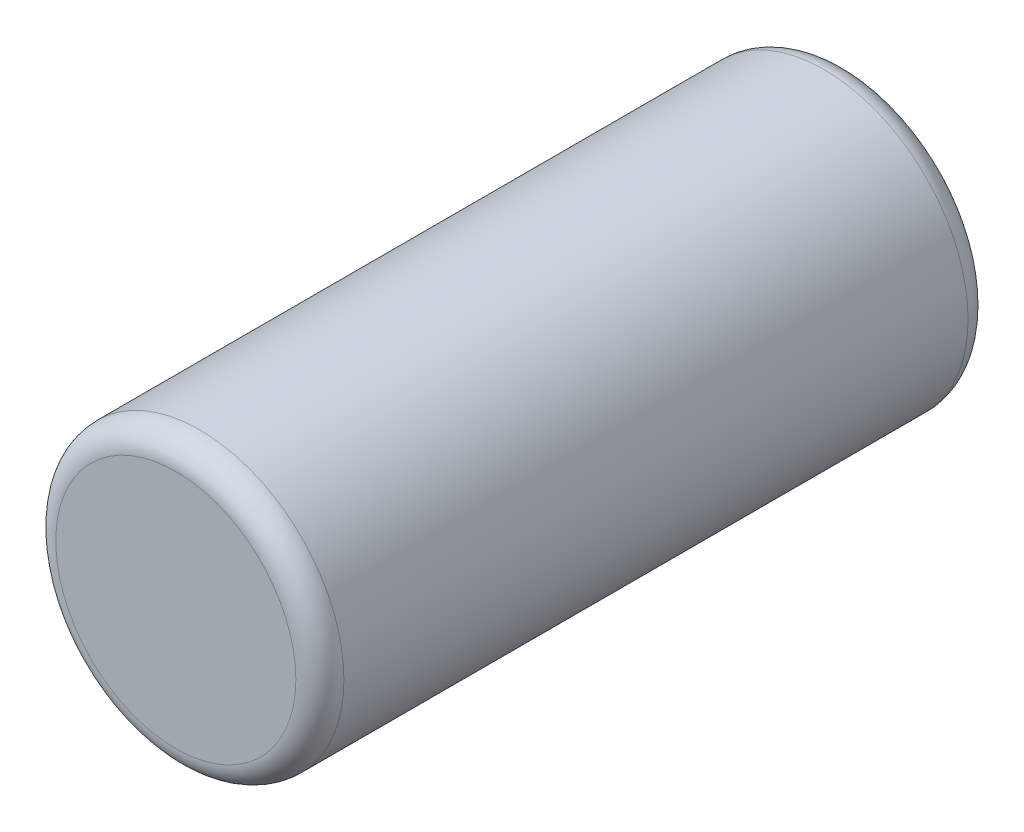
from build123d import *

# Parameters (mm, degrees)
SKETCH_1_R      = 3
EXTRUDE_1_DEPTH = 7
FILLET_1_R      = 0.5


with BuildPart() as part:
    # Sketch 1 → Extrude 1 (new, symmetric)
    with BuildSketch(Plane.XY):
        Circle(SKETCH_1_R)
    extrude(amount=EXTRUDE_1_DEPTH, both=True)

    # Fillet 1
    fillet_1_edges = [part.edges().sort_by_distance(p)[0] for p in [
        (-3, 0, -7),
        (-3, 0, 7),
    ]]
    fillet(fillet_1_edges, radius=FILLET_1_R)


solid = part.part
